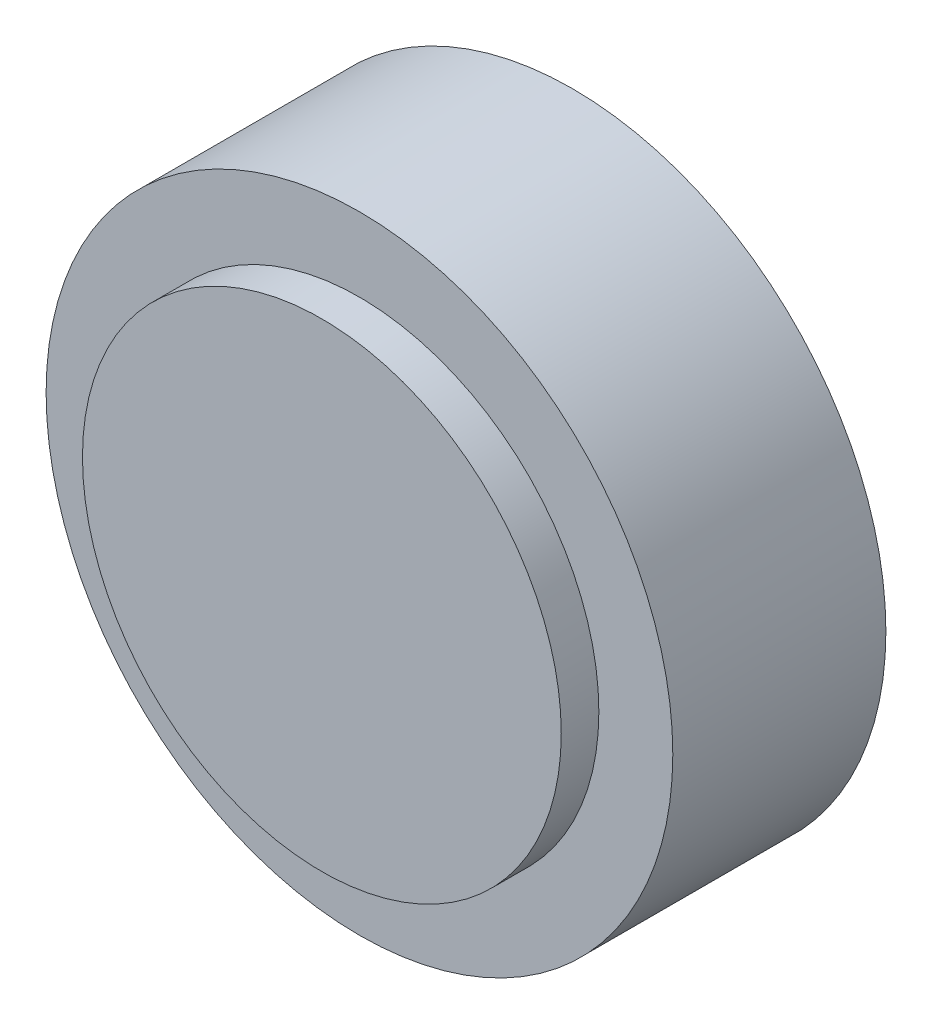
ISO-10303-21;
HEADER;
FILE_DESCRIPTION(('STEP AP214'),'2;1');
FILE_NAME('part.step','',(''),(''),'','','');
FILE_SCHEMA(('AUTOMOTIVE_DESIGN { 1 0 10303 214 1 1 1 1 }'));
ENDSEC;
DATA;
#1=APPLICATION_CONTEXT('core data for automotive mechanical design processes');
#2=APPLICATION_PROTOCOL_DEFINITION('international standard','automotive_design',2000,#1);
#3=PRODUCT_CONTEXT('',#1,'mechanical');
#4=PRODUCT('Part','Part','',(#3));
#5=PRODUCT_RELATED_PRODUCT_CATEGORY('part','',(#4));
#6=PRODUCT_DEFINITION_FORMATION('','',#4);
#7=PRODUCT_DEFINITION_CONTEXT('part definition',#1,'design');
#8=PRODUCT_DEFINITION('design','',#6,#7);
#9=PRODUCT_DEFINITION_SHAPE('','',#8);
#10=(LENGTH_UNIT() NAMED_UNIT(*) SI_UNIT(.MILLI.,.METRE.));
#11=(NAMED_UNIT(*) PLANE_ANGLE_UNIT() SI_UNIT($,.RADIAN.));
#12=(NAMED_UNIT(*) SI_UNIT($,.STERADIAN.) SOLID_ANGLE_UNIT());
#13=UNCERTAINTY_MEASURE_WITH_UNIT(LENGTH_MEASURE(1.E-05),#10,'distance_accuracy_value','');
#14=(GEOMETRIC_REPRESENTATION_CONTEXT(3) GLOBAL_UNCERTAINTY_ASSIGNED_CONTEXT((#13)) GLOBAL_UNIT_ASSIGNED_CONTEXT((#10,
#11,#12)) REPRESENTATION_CONTEXT('',''));
#15=CARTESIAN_POINT('',(0.,0.,0.));
#16=DIRECTION('',(0.,0.,1.));
#17=DIRECTION('',(1.,0.,0.));
#18=AXIS2_PLACEMENT_3D('',#15,#16,#17);
#19=CARTESIAN_POINT('',(0.,0.,30.));
#20=DIRECTION('',(0.,0.,1.));
#21=DIRECTION('',(1.,0.,0.));
#22=AXIS2_PLACEMENT_3D('',#19,#20,#21);
#23=CYLINDRICAL_SURFACE('',#22,12.5);
#24=CARTESIAN_POINT('',(0.,0.,0.));
#25=DIRECTION('',(0.,0.,1.));
#26=DIRECTION('',(1.,0.,0.));
#27=AXIS2_PLACEMENT_3D('',#24,#25,#26);
#28=CIRCLE('',#27,12.5);
#29=CARTESIAN_POINT('',(12.5,0.,0.));
#30=VERTEX_POINT('',#29);
#31=EDGE_CURVE('E19',#30,#30,#28,.T.);
#32=ORIENTED_EDGE('',*,*,#31,.T.);
#33=EDGE_LOOP('',(#32));
#34=FACE_BOUND('',#33,.T.);
#35=CARTESIAN_POINT('',(0.,0.,8.5));
#36=DIRECTION('',(0.,0.,1.));
#37=DIRECTION('',(1.,0.,0.));
#38=AXIS2_PLACEMENT_3D('',#35,#36,#37);
#39=CIRCLE('',#38,12.5);
#40=CARTESIAN_POINT('',(12.5,0.,8.5));
#41=VERTEX_POINT('',#40);
#42=EDGE_CURVE('E28',#41,#41,#39,.T.);
#43=ORIENTED_EDGE('',*,*,#42,.F.);
#44=EDGE_LOOP('',(#43));
#45=FACE_BOUND('',#44,.T.);
#46=ADVANCED_FACE('F12',(#34,#45),#23,.T.);
#47=CARTESIAN_POINT('',(0.,0.,30.));
#48=DIRECTION('',(0.,0.,1.));
#49=DIRECTION('',(1.,0.,0.));
#50=AXIS2_PLACEMENT_3D('',#47,#48,#49);
#51=CYLINDRICAL_SURFACE('',#50,3.);
#52=CARTESIAN_POINT('',(0.,0.,5.8));
#53=DIRECTION('',(0.,0.,-1.));
#54=DIRECTION('',(-1.,0.,0.));
#55=AXIS2_PLACEMENT_3D('',#52,#53,#54);
#56=CIRCLE('',#55,3.);
#57=CARTESIAN_POINT('',(-3.,0.,5.8));
#58=VERTEX_POINT('',#57);
#59=EDGE_CURVE('E31',#58,#58,#56,.T.);
#60=ORIENTED_EDGE('',*,*,#59,.F.);
#61=EDGE_LOOP('',(#60));
#62=FACE_BOUND('',#61,.T.);
#63=CARTESIAN_POINT('',(0.,0.,0.));
#64=DIRECTION('',(0.,0.,1.));
#65=DIRECTION('',(1.,0.,0.));
#66=AXIS2_PLACEMENT_3D('',#63,#64,#65);
#67=CIRCLE('',#66,3.);
#68=CARTESIAN_POINT('',(3.,0.,0.));
#69=VERTEX_POINT('',#68);
#70=EDGE_CURVE('E8',#69,#69,#67,.T.);
#71=ORIENTED_EDGE('',*,*,#70,.F.);
#72=EDGE_LOOP('',(#71));
#73=FACE_BOUND('',#72,.T.);
#74=ADVANCED_FACE('F37',(#62,#73),#51,.F.);
#75=CARTESIAN_POINT('',(3.,0.,0.));
#76=DIRECTION('',(0.,0.,1.));
#77=DIRECTION('',(1.,0.,0.));
#78=AXIS2_PLACEMENT_3D('',#75,#76,#77);
#79=PLANE('',#78);
#80=ORIENTED_EDGE('',*,*,#31,.F.);
#81=EDGE_LOOP('',(#80));
#82=FACE_BOUND('',#81,.T.);
#83=ORIENTED_EDGE('',*,*,#70,.T.);
#84=EDGE_LOOP('',(#83));
#85=FACE_BOUND('',#84,.T.);
#86=ADVANCED_FACE('F40',(#82,#85),#79,.F.);
#87=CARTESIAN_POINT('',(0.,0.,20.));
#88=DIRECTION('',(0.,0.,1.));
#89=DIRECTION('',(1.,0.,0.));
#90=AXIS2_PLACEMENT_3D('',#87,#88,#89);
#91=CYLINDRICAL_SURFACE('',#90,9.55);
#92=CARTESIAN_POINT('',(0.,0.,8.5));
#93=DIRECTION('',(0.,0.,1.));
#94=DIRECTION('',(1.,0.,0.));
#95=AXIS2_PLACEMENT_3D('',#92,#93,#94);
#96=CIRCLE('',#95,9.55);
#97=CARTESIAN_POINT('',(9.55,0.,8.5));
#98=VERTEX_POINT('',#97);
#99=EDGE_CURVE('E25',#98,#98,#96,.T.);
#100=ORIENTED_EDGE('',*,*,#99,.T.);
#101=EDGE_LOOP('',(#100));
#102=FACE_BOUND('',#101,.T.);
#103=CARTESIAN_POINT('',(0.,0.,10.));
#104=DIRECTION('',(0.,0.,-1.));
#105=DIRECTION('',(-1.,0.,0.));
#106=AXIS2_PLACEMENT_3D('',#103,#104,#105);
#107=CIRCLE('',#106,9.55);
#108=CARTESIAN_POINT('',(-9.55,0.,10.));
#109=VERTEX_POINT('',#108);
#110=EDGE_CURVE('E15',#109,#109,#107,.T.);
#111=ORIENTED_EDGE('',*,*,#110,.T.);
#112=EDGE_LOOP('',(#111));
#113=FACE_BOUND('',#112,.T.);
#114=ADVANCED_FACE('F48',(#102,#113),#91,.T.);
#115=CARTESIAN_POINT('',(-9.55,0.,8.5));
#116=DIRECTION('',(0.,0.,1.));
#117=DIRECTION('',(1.,0.,0.));
#118=AXIS2_PLACEMENT_3D('',#115,#116,#117);
#119=PLANE('',#118);
#120=ORIENTED_EDGE('',*,*,#42,.T.);
#121=EDGE_LOOP('',(#120));
#122=FACE_BOUND('',#121,.T.);
#123=ORIENTED_EDGE('',*,*,#99,.F.);
#124=EDGE_LOOP('',(#123));
#125=FACE_BOUND('',#124,.T.);
#126=ADVANCED_FACE('F55',(#122,#125),#119,.T.);
#127=CARTESIAN_POINT('',(12.5,0.,10.));
#128=DIRECTION('',(0.,0.,-1.));
#129=DIRECTION('',(-1.,0.,0.));
#130=AXIS2_PLACEMENT_3D('',#127,#128,#129);
#131=PLANE('',#130);
#132=ORIENTED_EDGE('',*,*,#110,.F.);
#133=EDGE_LOOP('',(#132));
#134=FACE_BOUND('',#133,.T.);
#135=ADVANCED_FACE('F53',(#134),#131,.F.);
#136=CARTESIAN_POINT('',(0.,0.,5.8));
#137=DIRECTION('',(0.,0.,-1.));
#138=DIRECTION('',(-1.,0.,0.));
#139=AXIS2_PLACEMENT_3D('',#136,#137,#138);
#140=PLANE('',#139);
#141=ORIENTED_EDGE('',*,*,#59,.T.);
#142=EDGE_LOOP('',(#141));
#143=FACE_BOUND('',#142,.T.);
#144=ADVANCED_FACE('F35',(#143),#140,.T.);
#145=CLOSED_SHELL('',(#46,#74,#86,#114,#126,#135,#144));
#146=MANIFOLD_SOLID_BREP('B1',#145);
#147=ADVANCED_BREP_SHAPE_REPRESENTATION('',(#18,#146),#14);
#148=SHAPE_DEFINITION_REPRESENTATION(#9,#147);
ENDSEC;
END-ISO-10303-21;
